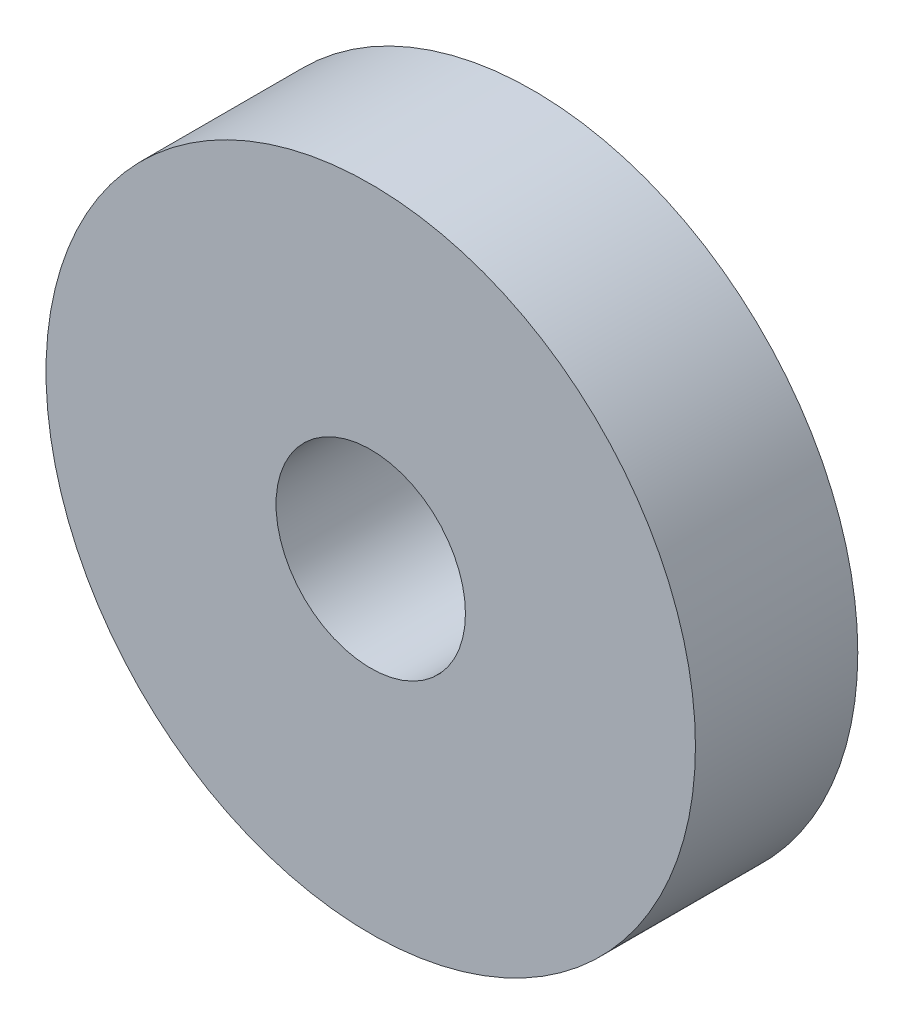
ISO-10303-21;
HEADER;
FILE_DESCRIPTION(('STEP AP214'),'2;1');
FILE_NAME('part.step','',(''),(''),'','','');
FILE_SCHEMA(('AUTOMOTIVE_DESIGN { 1 0 10303 214 1 1 1 1 }'));
ENDSEC;
DATA;
#1=APPLICATION_CONTEXT('core data for automotive mechanical design processes');
#2=APPLICATION_PROTOCOL_DEFINITION('international standard','automotive_design',2000,#1);
#3=PRODUCT_CONTEXT('',#1,'mechanical');
#4=PRODUCT('Part','Part','',(#3));
#5=PRODUCT_RELATED_PRODUCT_CATEGORY('part','',(#4));
#6=PRODUCT_DEFINITION_FORMATION('','',#4);
#7=PRODUCT_DEFINITION_CONTEXT('part definition',#1,'design');
#8=PRODUCT_DEFINITION('design','',#6,#7);
#9=PRODUCT_DEFINITION_SHAPE('','',#8);
#10=(LENGTH_UNIT() NAMED_UNIT(*) SI_UNIT(.MILLI.,.METRE.));
#11=(NAMED_UNIT(*) PLANE_ANGLE_UNIT() SI_UNIT($,.RADIAN.));
#12=(NAMED_UNIT(*) SI_UNIT($,.STERADIAN.) SOLID_ANGLE_UNIT());
#13=UNCERTAINTY_MEASURE_WITH_UNIT(LENGTH_MEASURE(1.E-05),#10,'distance_accuracy_value','');
#14=(GEOMETRIC_REPRESENTATION_CONTEXT(3) GLOBAL_UNCERTAINTY_ASSIGNED_CONTEXT((#13)) GLOBAL_UNIT_ASSIGNED_CONTEXT((#10,
#11,#12)) REPRESENTATION_CONTEXT('',''));
#15=CARTESIAN_POINT('',(0.,0.,0.));
#16=DIRECTION('',(0.,0.,1.));
#17=DIRECTION('',(1.,0.,0.));
#18=AXIS2_PLACEMENT_3D('',#15,#16,#17);
#19=CARTESIAN_POINT('',(0.,0.,3.));
#20=DIRECTION('',(0.,0.,1.));
#21=DIRECTION('',(1.,0.,0.));
#22=AXIS2_PLACEMENT_3D('',#19,#20,#21);
#23=PLANE('',#22);
#24=CARTESIAN_POINT('',(0.,0.,3.));
#25=DIRECTION('',(0.,0.,1.));
#26=DIRECTION('',(1.,0.,0.));
#27=AXIS2_PLACEMENT_3D('',#24,#25,#26);
#28=CIRCLE('',#27,6.);
#29=CARTESIAN_POINT('',(6.,0.,3.));
#30=VERTEX_POINT('',#29);
#31=EDGE_CURVE('E10',#30,#30,#28,.T.);
#32=ORIENTED_EDGE('',*,*,#31,.T.);
#33=EDGE_LOOP('',(#32));
#34=FACE_BOUND('',#33,.T.);
#35=CARTESIAN_POINT('',(0.,0.,3.));
#36=DIRECTION('',(0.,0.,1.));
#37=DIRECTION('',(1.,0.,0.));
#38=AXIS2_PLACEMENT_3D('',#35,#36,#37);
#39=CIRCLE('',#38,1.75);
#40=CARTESIAN_POINT('',(1.75,0.,3.));
#41=VERTEX_POINT('',#40);
#42=EDGE_CURVE('E42',#41,#41,#39,.T.);
#43=ORIENTED_EDGE('',*,*,#42,.F.);
#44=EDGE_LOOP('',(#43));
#45=FACE_BOUND('',#44,.T.);
#46=ADVANCED_FACE('F31',(#34,#45),#23,.T.);
#47=CARTESIAN_POINT('',(0.,0.,0.));
#48=DIRECTION('',(0.,0.,1.));
#49=DIRECTION('',(1.,0.,0.));
#50=AXIS2_PLACEMENT_3D('',#47,#48,#49);
#51=PLANE('',#50);
#52=CARTESIAN_POINT('',(0.,0.,0.));
#53=DIRECTION('',(0.,0.,1.));
#54=DIRECTION('',(1.,0.,0.));
#55=AXIS2_PLACEMENT_3D('',#52,#53,#54);
#56=CIRCLE('',#55,6.);
#57=CARTESIAN_POINT('',(6.,0.,0.));
#58=VERTEX_POINT('',#57);
#59=EDGE_CURVE('E35',#58,#58,#56,.T.);
#60=ORIENTED_EDGE('',*,*,#59,.F.);
#61=EDGE_LOOP('',(#60));
#62=FACE_BOUND('',#61,.T.);
#63=CARTESIAN_POINT('',(0.,0.,0.));
#64=DIRECTION('',(0.,0.,1.));
#65=DIRECTION('',(1.,0.,0.));
#66=AXIS2_PLACEMENT_3D('',#63,#64,#65);
#67=CIRCLE('',#66,1.75);
#68=CARTESIAN_POINT('',(1.75,0.,0.));
#69=VERTEX_POINT('',#68);
#70=EDGE_CURVE('E44',#69,#69,#67,.T.);
#71=ORIENTED_EDGE('',*,*,#70,.T.);
#72=EDGE_LOOP('',(#71));
#73=FACE_BOUND('',#72,.T.);
#74=ADVANCED_FACE('F54',(#62,#73),#51,.F.);
#75=CARTESIAN_POINT('',(0.,0.,3.));
#76=DIRECTION('',(0.,0.,-1.));
#77=DIRECTION('',(-1.,0.,0.));
#78=AXIS2_PLACEMENT_3D('',#75,#76,#77);
#79=CYLINDRICAL_SURFACE('',#78,6.);
#80=ORIENTED_EDGE('',*,*,#31,.F.);
#81=EDGE_LOOP('',(#80));
#82=FACE_BOUND('',#81,.T.);
#83=ORIENTED_EDGE('',*,*,#59,.T.);
#84=EDGE_LOOP('',(#83));
#85=FACE_BOUND('',#84,.T.);
#86=ADVANCED_FACE('F33',(#82,#85),#79,.T.);
#87=CARTESIAN_POINT('',(0.,0.,3.));
#88=DIRECTION('',(0.,0.,-1.));
#89=DIRECTION('',(-1.,0.,0.));
#90=AXIS2_PLACEMENT_3D('',#87,#88,#89);
#91=CYLINDRICAL_SURFACE('',#90,1.75);
#92=ORIENTED_EDGE('',*,*,#42,.T.);
#93=EDGE_LOOP('',(#92));
#94=FACE_BOUND('',#93,.T.);
#95=ORIENTED_EDGE('',*,*,#70,.F.);
#96=EDGE_LOOP('',(#95));
#97=FACE_BOUND('',#96,.T.);
#98=ADVANCED_FACE('F50',(#94,#97),#91,.F.);
#99=CLOSED_SHELL('',(#46,#74,#86,#98));
#100=MANIFOLD_SOLID_BREP('B2',#99);
#101=ADVANCED_BREP_SHAPE_REPRESENTATION('',(#18,#100),#14);
#102=SHAPE_DEFINITION_REPRESENTATION(#9,#101);
ENDSEC;
END-ISO-10303-21;
